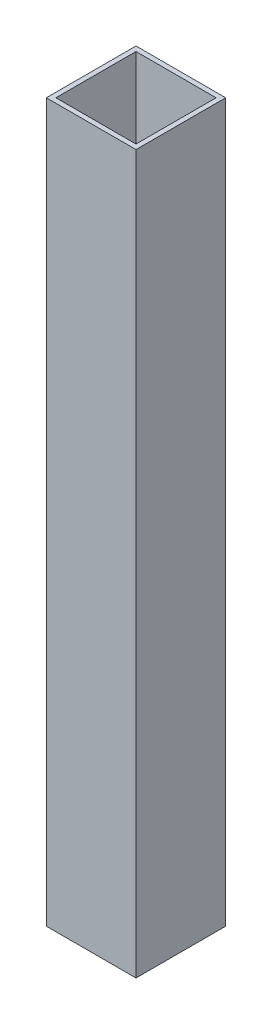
ISO-10303-21;
HEADER;
FILE_DESCRIPTION(('STEP AP214'),'2;1');
FILE_NAME('part.step','',(''),(''),'','','');
FILE_SCHEMA(('AUTOMOTIVE_DESIGN { 1 0 10303 214 1 1 1 1 }'));
ENDSEC;
DATA;
#1=APPLICATION_CONTEXT('core data for automotive mechanical design processes');
#2=APPLICATION_PROTOCOL_DEFINITION('international standard','automotive_design',2000,#1);
#3=PRODUCT_CONTEXT('',#1,'mechanical');
#4=PRODUCT('Part','Part','',(#3));
#5=PRODUCT_RELATED_PRODUCT_CATEGORY('part','',(#4));
#6=PRODUCT_DEFINITION_FORMATION('','',#4);
#7=PRODUCT_DEFINITION_CONTEXT('part definition',#1,'design');
#8=PRODUCT_DEFINITION('design','',#6,#7);
#9=PRODUCT_DEFINITION_SHAPE('','',#8);
#10=(LENGTH_UNIT() NAMED_UNIT(*) SI_UNIT(.MILLI.,.METRE.));
#11=(NAMED_UNIT(*) PLANE_ANGLE_UNIT() SI_UNIT($,.RADIAN.));
#12=(NAMED_UNIT(*) SI_UNIT($,.STERADIAN.) SOLID_ANGLE_UNIT());
#13=UNCERTAINTY_MEASURE_WITH_UNIT(LENGTH_MEASURE(1.E-05),#10,'distance_accuracy_value','');
#14=(GEOMETRIC_REPRESENTATION_CONTEXT(3) GLOBAL_UNCERTAINTY_ASSIGNED_CONTEXT((#13)) GLOBAL_UNIT_ASSIGNED_CONTEXT((#10,
#11,#12)) REPRESENTATION_CONTEXT('',''));
#15=CARTESIAN_POINT('',(0.,0.,0.));
#16=DIRECTION('',(0.,0.,1.));
#17=DIRECTION('',(1.,0.,0.));
#18=AXIS2_PLACEMENT_3D('',#15,#16,#17);
#19=CARTESIAN_POINT('',(0.,609.6,0.));
#20=DIRECTION('',(0.,-1.,0.));
#21=DIRECTION('',(0.,0.,-1.));
#22=AXIS2_PLACEMENT_3D('',#19,#20,#21);
#23=PLANE('',#22);
#24=DIRECTION('',(0.,0.,-1.));
#25=VECTOR('',#24,1.);
#26=CARTESIAN_POINT('',(38.1,609.6,38.1));
#27=LINE('',#26,#25);
#28=CARTESIAN_POINT('',(38.1,609.6,38.1));
#29=VERTEX_POINT('',#28);
#30=CARTESIAN_POINT('',(38.1,609.6,-38.1));
#31=VERTEX_POINT('',#30);
#32=EDGE_CURVE('E158',#29,#31,#27,.T.);
#33=ORIENTED_EDGE('',*,*,#32,.T.);
#34=DIRECTION('',(-1.,0.,0.));
#35=VECTOR('',#34,1.);
#36=CARTESIAN_POINT('',(-38.1,609.6,-38.1));
#37=LINE('',#36,#35);
#38=CARTESIAN_POINT('',(-38.1,609.6,-38.1));
#39=VERTEX_POINT('',#38);
#40=EDGE_CURVE('E162',#31,#39,#37,.T.);
#41=ORIENTED_EDGE('',*,*,#40,.T.);
#42=DIRECTION('',(0.,0.,1.));
#43=VECTOR('',#42,1.);
#44=CARTESIAN_POINT('',(-38.1,609.6,38.1));
#45=LINE('',#44,#43);
#46=CARTESIAN_POINT('',(-38.1,609.6,38.1));
#47=VERTEX_POINT('',#46);
#48=EDGE_CURVE('E166',#39,#47,#45,.T.);
#49=ORIENTED_EDGE('',*,*,#48,.T.);
#50=DIRECTION('',(1.,0.,0.));
#51=VECTOR('',#50,1.);
#52=CARTESIAN_POINT('',(-38.1,609.6,38.1));
#53=LINE('',#52,#51);
#54=EDGE_CURVE('E169',#47,#29,#53,.T.);
#55=ORIENTED_EDGE('',*,*,#54,.T.);
#56=EDGE_LOOP('',(#33,#41,#49,#55));
#57=FACE_BOUND('',#56,.T.);
#58=DIRECTION('',(0.,0.,-1.));
#59=VECTOR('',#58,1.);
#60=CARTESIAN_POINT('',(34.036,609.6,34.036));
#61=LINE('',#60,#59);
#62=CARTESIAN_POINT('',(34.036,609.6,34.036));
#63=VERTEX_POINT('',#62);
#64=CARTESIAN_POINT('',(34.036,609.6,-34.036));
#65=VERTEX_POINT('',#64);
#66=EDGE_CURVE('E109',#63,#65,#61,.T.);
#67=ORIENTED_EDGE('',*,*,#66,.F.);
#68=DIRECTION('',(1.,0.,0.));
#69=VECTOR('',#68,1.);
#70=CARTESIAN_POINT('',(-34.036,609.6,34.036));
#71=LINE('',#70,#69);
#72=CARTESIAN_POINT('',(-34.036,609.6,34.036));
#73=VERTEX_POINT('',#72);
#74=EDGE_CURVE('E136',#73,#63,#71,.T.);
#75=ORIENTED_EDGE('',*,*,#74,.F.);
#76=DIRECTION('',(0.,0.,1.));
#77=VECTOR('',#76,1.);
#78=CARTESIAN_POINT('',(-34.036,609.6,34.036));
#79=LINE('',#78,#77);
#80=CARTESIAN_POINT('',(-34.036,609.6,-34.036));
#81=VERTEX_POINT('',#80);
#82=EDGE_CURVE('E131',#81,#73,#79,.T.);
#83=ORIENTED_EDGE('',*,*,#82,.F.);
#84=DIRECTION('',(-1.,0.,0.));
#85=VECTOR('',#84,1.);
#86=CARTESIAN_POINT('',(-34.036,609.6,-34.036));
#87=LINE('',#86,#85);
#88=EDGE_CURVE('E118',#65,#81,#87,.T.);
#89=ORIENTED_EDGE('',*,*,#88,.F.);
#90=EDGE_LOOP('',(#67,#75,#83,#89));
#91=FACE_BOUND('',#90,.T.);
#92=ADVANCED_FACE('F43',(#57,#91),#23,.F.);
#93=CARTESIAN_POINT('',(0.,0.,0.));
#94=DIRECTION('',(0.,-1.,0.));
#95=DIRECTION('',(0.,0.,-1.));
#96=AXIS2_PLACEMENT_3D('',#93,#94,#95);
#97=PLANE('',#96);
#98=DIRECTION('',(0.,0.,-1.));
#99=VECTOR('',#98,1.);
#100=CARTESIAN_POINT('',(38.1,0.,38.1));
#101=LINE('',#100,#99);
#102=CARTESIAN_POINT('',(38.1,0.,38.1));
#103=VERTEX_POINT('',#102);
#104=CARTESIAN_POINT('',(38.1,0.,-38.1));
#105=VERTEX_POINT('',#104);
#106=EDGE_CURVE('E127',#103,#105,#101,.T.);
#107=ORIENTED_EDGE('',*,*,#106,.F.);
#108=DIRECTION('',(1.,0.,0.));
#109=VECTOR('',#108,1.);
#110=CARTESIAN_POINT('',(-38.1,0.,38.1));
#111=LINE('',#110,#109);
#112=CARTESIAN_POINT('',(-38.1,0.,38.1));
#113=VERTEX_POINT('',#112);
#114=EDGE_CURVE('E163',#113,#103,#111,.T.);
#115=ORIENTED_EDGE('',*,*,#114,.F.);
#116=DIRECTION('',(0.,0.,1.));
#117=VECTOR('',#116,1.);
#118=CARTESIAN_POINT('',(-38.1,0.,38.1));
#119=LINE('',#118,#117);
#120=CARTESIAN_POINT('',(-38.1,0.,-38.1));
#121=VERTEX_POINT('',#120);
#122=EDGE_CURVE('E179',#121,#113,#119,.T.);
#123=ORIENTED_EDGE('',*,*,#122,.F.);
#124=DIRECTION('',(-1.,0.,0.));
#125=VECTOR('',#124,1.);
#126=CARTESIAN_POINT('',(-38.1,0.,-38.1));
#127=LINE('',#126,#125);
#128=EDGE_CURVE('E176',#105,#121,#127,.T.);
#129=ORIENTED_EDGE('',*,*,#128,.F.);
#130=EDGE_LOOP('',(#107,#115,#123,#129));
#131=FACE_BOUND('',#130,.T.);
#132=DIRECTION('',(1.,0.,0.));
#133=VECTOR('',#132,1.);
#134=CARTESIAN_POINT('',(-34.036,0.,34.036));
#135=LINE('',#134,#133);
#136=CARTESIAN_POINT('',(-34.036,0.,34.036));
#137=VERTEX_POINT('',#136);
#138=CARTESIAN_POINT('',(34.036,0.,34.036));
#139=VERTEX_POINT('',#138);
#140=EDGE_CURVE('E119',#137,#139,#135,.T.);
#141=ORIENTED_EDGE('',*,*,#140,.T.);
#142=DIRECTION('',(0.,0.,-1.));
#143=VECTOR('',#142,1.);
#144=CARTESIAN_POINT('',(34.036,0.,34.036));
#145=LINE('',#144,#143);
#146=CARTESIAN_POINT('',(34.036,0.,-34.036));
#147=VERTEX_POINT('',#146);
#148=EDGE_CURVE('E67',#139,#147,#145,.T.);
#149=ORIENTED_EDGE('',*,*,#148,.T.);
#150=DIRECTION('',(-1.,0.,0.));
#151=VECTOR('',#150,1.);
#152=CARTESIAN_POINT('',(-34.036,0.,-34.036));
#153=LINE('',#152,#151);
#154=CARTESIAN_POINT('',(-34.036,0.,-34.036));
#155=VERTEX_POINT('',#154);
#156=EDGE_CURVE('E125',#147,#155,#153,.T.);
#157=ORIENTED_EDGE('',*,*,#156,.T.);
#158=DIRECTION('',(0.,0.,1.));
#159=VECTOR('',#158,1.);
#160=CARTESIAN_POINT('',(-34.036,0.,34.036));
#161=LINE('',#160,#159);
#162=EDGE_CURVE('E145',#155,#137,#161,.T.);
#163=ORIENTED_EDGE('',*,*,#162,.T.);
#164=EDGE_LOOP('',(#141,#149,#157,#163));
#165=FACE_BOUND('',#164,.T.);
#166=ADVANCED_FACE('F203',(#131,#165),#97,.T.);
#167=CARTESIAN_POINT('',(38.1,609.6,38.1));
#168=DIRECTION('',(-1.,0.,0.));
#169=DIRECTION('',(0.,0.,1.));
#170=AXIS2_PLACEMENT_3D('',#167,#168,#169);
#171=PLANE('',#170);
#172=ORIENTED_EDGE('',*,*,#106,.T.);
#173=DIRECTION('',(0.,-1.,0.));
#174=VECTOR('',#173,1.);
#175=CARTESIAN_POINT('',(38.1,609.6,-38.1));
#176=LINE('',#175,#174);
#177=EDGE_CURVE('E11',#31,#105,#176,.T.);
#178=ORIENTED_EDGE('',*,*,#177,.F.);
#179=ORIENTED_EDGE('',*,*,#32,.F.);
#180=DIRECTION('',(0.,-1.,0.));
#181=VECTOR('',#180,1.);
#182=CARTESIAN_POINT('',(38.1,609.6,38.1));
#183=LINE('',#182,#181);
#184=EDGE_CURVE('E172',#29,#103,#183,.T.);
#185=ORIENTED_EDGE('',*,*,#184,.T.);
#186=EDGE_LOOP('',(#172,#178,#179,#185));
#187=FACE_BOUND('',#186,.T.);
#188=ADVANCED_FACE('F45',(#187),#171,.F.);
#189=CARTESIAN_POINT('',(-38.1,609.6,-38.1));
#190=DIRECTION('',(0.,0.,1.));
#191=DIRECTION('',(1.,0.,0.));
#192=AXIS2_PLACEMENT_3D('',#189,#190,#191);
#193=PLANE('',#192);
#194=ORIENTED_EDGE('',*,*,#128,.T.);
#195=DIRECTION('',(0.,-1.,0.));
#196=VECTOR('',#195,1.);
#197=CARTESIAN_POINT('',(-38.1,609.6,-38.1));
#198=LINE('',#197,#196);
#199=EDGE_CURVE('E52',#39,#121,#198,.T.);
#200=ORIENTED_EDGE('',*,*,#199,.F.);
#201=ORIENTED_EDGE('',*,*,#40,.F.);
#202=ORIENTED_EDGE('',*,*,#177,.T.);
#203=EDGE_LOOP('',(#194,#200,#201,#202));
#204=FACE_BOUND('',#203,.T.);
#205=ADVANCED_FACE('F213',(#204),#193,.F.);
#206=CARTESIAN_POINT('',(-38.1,609.6,38.1));
#207=DIRECTION('',(1.,0.,0.));
#208=DIRECTION('',(0.,0.,-1.));
#209=AXIS2_PLACEMENT_3D('',#206,#207,#208);
#210=PLANE('',#209);
#211=ORIENTED_EDGE('',*,*,#122,.T.);
#212=DIRECTION('',(0.,-1.,0.));
#213=VECTOR('',#212,1.);
#214=CARTESIAN_POINT('',(-38.1,609.6,38.1));
#215=LINE('',#214,#213);
#216=EDGE_CURVE('E187',#47,#113,#215,.T.);
#217=ORIENTED_EDGE('',*,*,#216,.F.);
#218=ORIENTED_EDGE('',*,*,#48,.F.);
#219=ORIENTED_EDGE('',*,*,#199,.T.);
#220=EDGE_LOOP('',(#211,#217,#218,#219));
#221=FACE_BOUND('',#220,.T.);
#222=ADVANCED_FACE('F197',(#221),#210,.F.);
#223=CARTESIAN_POINT('',(-38.1,609.6,38.1));
#224=DIRECTION('',(0.,0.,-1.));
#225=DIRECTION('',(-1.,0.,0.));
#226=AXIS2_PLACEMENT_3D('',#223,#224,#225);
#227=PLANE('',#226);
#228=ORIENTED_EDGE('',*,*,#114,.T.);
#229=ORIENTED_EDGE('',*,*,#184,.F.);
#230=ORIENTED_EDGE('',*,*,#54,.F.);
#231=ORIENTED_EDGE('',*,*,#216,.T.);
#232=EDGE_LOOP('',(#228,#229,#230,#231));
#233=FACE_BOUND('',#232,.T.);
#234=ADVANCED_FACE('F207',(#233),#227,.F.);
#235=CARTESIAN_POINT('',(34.036,609.6,34.036));
#236=DIRECTION('',(-1.,0.,0.));
#237=DIRECTION('',(0.,0.,1.));
#238=AXIS2_PLACEMENT_3D('',#235,#236,#237);
#239=PLANE('',#238);
#240=ORIENTED_EDGE('',*,*,#148,.F.);
#241=DIRECTION('',(0.,-1.,0.));
#242=VECTOR('',#241,1.);
#243=CARTESIAN_POINT('',(34.036,609.6,34.036));
#244=LINE('',#243,#242);
#245=EDGE_CURVE('E113',#63,#139,#244,.T.);
#246=ORIENTED_EDGE('',*,*,#245,.F.);
#247=ORIENTED_EDGE('',*,*,#66,.T.);
#248=DIRECTION('',(0.,-1.,0.));
#249=VECTOR('',#248,1.);
#250=CARTESIAN_POINT('',(34.036,609.6,-34.036));
#251=LINE('',#250,#249);
#252=EDGE_CURVE('E112',#65,#147,#251,.T.);
#253=ORIENTED_EDGE('',*,*,#252,.T.);
#254=EDGE_LOOP('',(#240,#246,#247,#253));
#255=FACE_BOUND('',#254,.T.);
#256=ADVANCED_FACE('F111',(#255),#239,.T.);
#257=CARTESIAN_POINT('',(-34.036,609.6,-34.036));
#258=DIRECTION('',(0.,0.,1.));
#259=DIRECTION('',(1.,0.,0.));
#260=AXIS2_PLACEMENT_3D('',#257,#258,#259);
#261=PLANE('',#260);
#262=ORIENTED_EDGE('',*,*,#156,.F.);
#263=ORIENTED_EDGE('',*,*,#252,.F.);
#264=ORIENTED_EDGE('',*,*,#88,.T.);
#265=DIRECTION('',(0.,-1.,0.));
#266=VECTOR('',#265,1.);
#267=CARTESIAN_POINT('',(-34.036,609.6,-34.036));
#268=LINE('',#267,#266);
#269=EDGE_CURVE('E128',#81,#155,#268,.T.);
#270=ORIENTED_EDGE('',*,*,#269,.T.);
#271=EDGE_LOOP('',(#262,#263,#264,#270));
#272=FACE_BOUND('',#271,.T.);
#273=ADVANCED_FACE('F122',(#272),#261,.T.);
#274=CARTESIAN_POINT('',(-34.036,609.6,34.036));
#275=DIRECTION('',(1.,0.,0.));
#276=DIRECTION('',(0.,0.,-1.));
#277=AXIS2_PLACEMENT_3D('',#274,#275,#276);
#278=PLANE('',#277);
#279=ORIENTED_EDGE('',*,*,#162,.F.);
#280=ORIENTED_EDGE('',*,*,#269,.F.);
#281=ORIENTED_EDGE('',*,*,#82,.T.);
#282=DIRECTION('',(0.,-1.,0.));
#283=VECTOR('',#282,1.);
#284=CARTESIAN_POINT('',(-34.036,609.6,34.036));
#285=LINE('',#284,#283);
#286=EDGE_CURVE('E59',#73,#137,#285,.T.);
#287=ORIENTED_EDGE('',*,*,#286,.T.);
#288=EDGE_LOOP('',(#279,#280,#281,#287));
#289=FACE_BOUND('',#288,.T.);
#290=ADVANCED_FACE('F236',(#289),#278,.T.);
#291=CARTESIAN_POINT('',(-34.036,609.6,34.036));
#292=DIRECTION('',(0.,0.,-1.));
#293=DIRECTION('',(-1.,0.,0.));
#294=AXIS2_PLACEMENT_3D('',#291,#292,#293);
#295=PLANE('',#294);
#296=ORIENTED_EDGE('',*,*,#140,.F.);
#297=ORIENTED_EDGE('',*,*,#286,.F.);
#298=ORIENTED_EDGE('',*,*,#74,.T.);
#299=ORIENTED_EDGE('',*,*,#245,.T.);
#300=EDGE_LOOP('',(#296,#297,#298,#299));
#301=FACE_BOUND('',#300,.T.);
#302=ADVANCED_FACE('F240',(#301),#295,.T.);
#303=CLOSED_SHELL('',(#92,#166,#188,#205,#222,#234,#256,#273,#290,#302));
#304=MANIFOLD_SOLID_BREP('B2',#303);
#305=ADVANCED_BREP_SHAPE_REPRESENTATION('',(#18,#304),#14);
#306=SHAPE_DEFINITION_REPRESENTATION(#9,#305);
ENDSEC;
END-ISO-10303-21;
